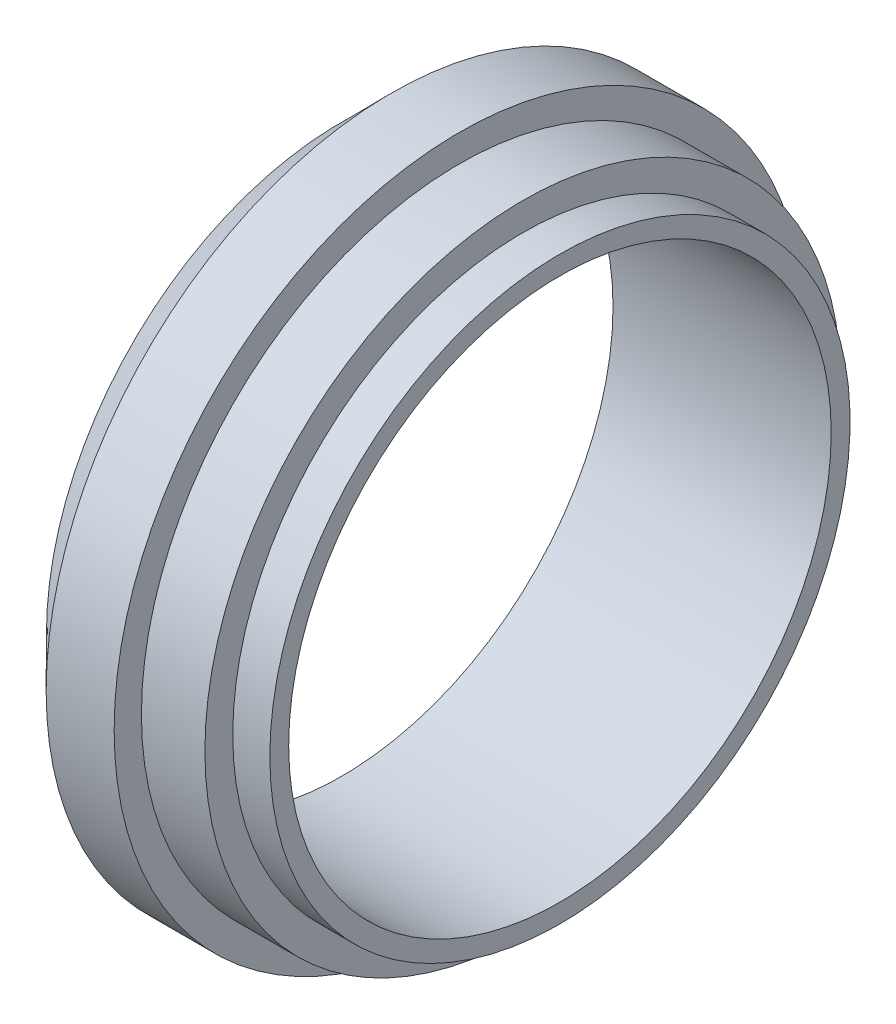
from build123d import *

# Parameters (mm, degrees)
SKETCH4_R          = 23.749
CUT_EXTRUDE1_DEPTH = 20.6375


with BuildPart() as part:
    # Sketch1 → Revolve1 (revolve)
    with BuildSketch(Plane.XY, mode=Mode.PRIVATE) as revolve1_sk:
        Polygon((0, 0), (-3.24612, 0), (-3.24612, -2.4384), (-8.80364, -2.4384), (-8.80364, -4.826), (-14.7574, -4.826), (-19.1008, -0.4572), (-19.1008, 25.4), (0, 25.4), align=None)
    revolve(revolve1_sk.sketch.rotate(Axis((-19.1008, 25.4, 0), (1, 0, 0)), 270), axis=Axis((-19.1008, 25.4, 0), (1, 0, 0)))

    # Sketch4 → Cut-Extrude1 (cut)
    with BuildSketch(Plane.ZY.offset(19.1008)):
        with Locations((0, 25.4)):
            Circle(SKETCH4_R)
    extrude(amount=-CUT_EXTRUDE1_DEPTH, mode=Mode.SUBTRACT)


solid = part.part
